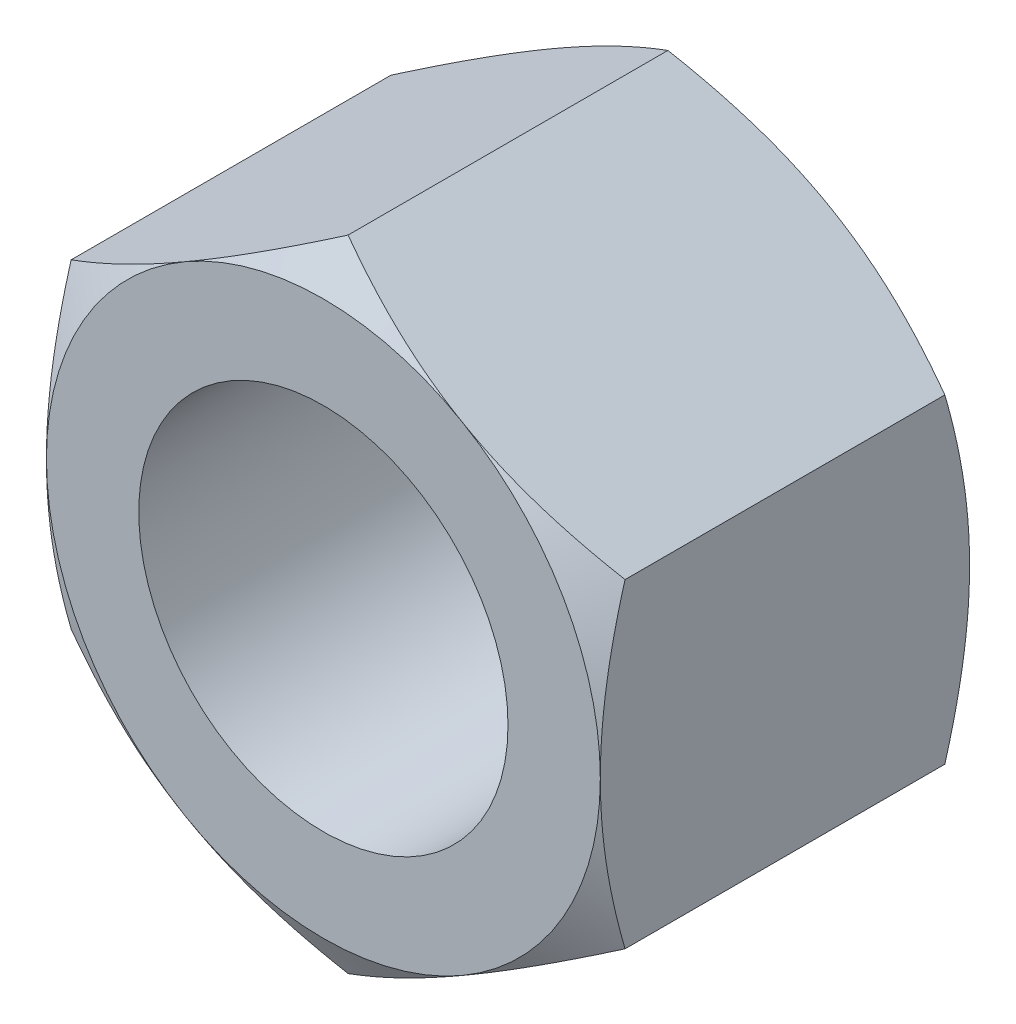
ISO-10303-21;
HEADER;
FILE_DESCRIPTION(('STEP AP214'),'2;1');
FILE_NAME('part.step','',(''),(''),'','','');
FILE_SCHEMA(('AUTOMOTIVE_DESIGN { 1 0 10303 214 1 1 1 1 }'));
ENDSEC;
DATA;
#1=APPLICATION_CONTEXT('core data for automotive mechanical design processes');
#2=APPLICATION_PROTOCOL_DEFINITION('international standard','automotive_design',2000,#1);
#3=PRODUCT_CONTEXT('',#1,'mechanical');
#4=PRODUCT('Part','Part','',(#3));
#5=PRODUCT_RELATED_PRODUCT_CATEGORY('part','',(#4));
#6=PRODUCT_DEFINITION_FORMATION('','',#4);
#7=PRODUCT_DEFINITION_CONTEXT('part definition',#1,'design');
#8=PRODUCT_DEFINITION('design','',#6,#7);
#9=PRODUCT_DEFINITION_SHAPE('','',#8);
#10=(LENGTH_UNIT() NAMED_UNIT(*) SI_UNIT(.MILLI.,.METRE.));
#11=(NAMED_UNIT(*) PLANE_ANGLE_UNIT() SI_UNIT($,.RADIAN.));
#12=(NAMED_UNIT(*) SI_UNIT($,.STERADIAN.) SOLID_ANGLE_UNIT());
#13=UNCERTAINTY_MEASURE_WITH_UNIT(LENGTH_MEASURE(1.E-05),#10,'distance_accuracy_value','');
#14=(GEOMETRIC_REPRESENTATION_CONTEXT(3) GLOBAL_UNCERTAINTY_ASSIGNED_CONTEXT((#13)) GLOBAL_UNIT_ASSIGNED_CONTEXT((#10,
#11,#12)) REPRESENTATION_CONTEXT('',''));
#15=CARTESIAN_POINT('',(0.,0.,0.));
#16=DIRECTION('',(0.,0.,1.));
#17=DIRECTION('',(1.,0.,0.));
#18=AXIS2_PLACEMENT_3D('',#15,#16,#17);
#19=CARTESIAN_POINT('',(-9.,15.5884572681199,0.));
#20=DIRECTION('',(0.,0.,-1.));
#21=DIRECTION('',(-1.,0.,0.));
#22=AXIS2_PLACEMENT_3D('',#19,#20,#21);
#23=PLANE('',#22);
#24=CARTESIAN_POINT('',(0.,0.,0.));
#25=DIRECTION('',(0.,0.,1.));
#26=DIRECTION('',(1.,0.,0.));
#27=AXIS2_PLACEMENT_3D('',#24,#25,#26);
#28=CIRCLE('',#27,6.);
#29=CARTESIAN_POINT('',(6.,0.,0.));
#30=VERTEX_POINT('',#29);
#31=EDGE_CURVE('E324',#30,#30,#28,.T.);
#32=ORIENTED_EDGE('',*,*,#31,.F.);
#33=EDGE_LOOP('',(#32));
#34=FACE_BOUND('',#33,.T.);
#35=CARTESIAN_POINT('',(0.,0.,0.));
#36=DIRECTION('',(0.,0.,-1.));
#37=DIRECTION('',(-1.,0.,0.));
#38=AXIS2_PLACEMENT_3D('',#35,#36,#37);
#39=CIRCLE('',#38,9.);
#40=CARTESIAN_POINT('',(-9.,0.,0.));
#41=VERTEX_POINT('',#40);
#42=CARTESIAN_POINT('',(-4.5,7.79422863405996,0.));
#43=VERTEX_POINT('',#42);
#44=EDGE_CURVE('E332',#41,#43,#39,.T.);
#45=ORIENTED_EDGE('',*,*,#44,.F.);
#46=CARTESIAN_POINT('',(0.,0.,0.));
#47=DIRECTION('',(0.,0.,-1.));
#48=DIRECTION('',(-1.,0.,0.));
#49=AXIS2_PLACEMENT_3D('',#46,#47,#48);
#50=CIRCLE('',#49,9.);
#51=CARTESIAN_POINT('',(-4.5,-7.79422863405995,0.));
#52=VERTEX_POINT('',#51);
#53=EDGE_CURVE('E154',#41,#52,#50,.F.);
#54=ORIENTED_EDGE('',*,*,#53,.T.);
#55=CARTESIAN_POINT('',(4.5,-7.79422863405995,0.));
#56=VERTEX_POINT('',#55);
#57=EDGE_CURVE('E256',#52,#56,#50,.F.);
#58=ORIENTED_EDGE('',*,*,#57,.T.);
#59=CARTESIAN_POINT('',(9.,0.,0.));
#60=VERTEX_POINT('',#59);
#61=EDGE_CURVE('E157',#56,#60,#50,.F.);
#62=ORIENTED_EDGE('',*,*,#61,.T.);
#63=CARTESIAN_POINT('',(4.5,7.79422863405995,0.));
#64=VERTEX_POINT('',#63);
#65=EDGE_CURVE('E132',#60,#64,#50,.F.);
#66=ORIENTED_EDGE('',*,*,#65,.T.);
#67=EDGE_CURVE('E145',#64,#43,#50,.F.);
#68=ORIENTED_EDGE('',*,*,#67,.T.);
#69=EDGE_LOOP('',(#45,#54,#58,#62,#66,#68));
#70=FACE_BOUND('',#69,.T.);
#71=ADVANCED_FACE('F37',(#34,#70),#23,.F.);
#72=CARTESIAN_POINT('',(0.,0.,0.));
#73=DIRECTION('',(0.,0.,-1.));
#74=DIRECTION('',(-1.,0.,0.));
#75=AXIS2_PLACEMENT_3D('',#72,#73,#74);
#76=CONICAL_SURFACE('',#75,9.,1.0471975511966);
#77=CARTESIAN_POINT('',(-9.,-14.08790952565,-4.4556038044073));
#78=CARTESIAN_POINT('',(-9.,-13.6936550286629,-4.26383430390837));
#79=CARTESIAN_POINT('',(-9.,-13.2985092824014,-4.07386641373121));
#80=CARTESIAN_POINT('',(-9.,-12.505961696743,-3.69854474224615));
#81=CARTESIAN_POINT('',(-9.,-12.1085595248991,-3.51319166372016));
#82=CARTESIAN_POINT('',(-9.,-11.309040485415,-3.14720601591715));
#83=CARTESIAN_POINT('',(-9.,-10.9069098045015,-2.96660352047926));
#84=CARTESIAN_POINT('',(-9.,-10.0994948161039,-2.61261874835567));
#85=CARTESIAN_POINT('',(-9.,-9.69421065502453,-2.43923613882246));
#86=CARTESIAN_POINT('',(-9.,-8.86637898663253,-2.09601068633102));
#87=CARTESIAN_POINT('',(-9.,-8.44370370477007,-1.92647435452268));
#88=CARTESIAN_POINT('',(-9.,-7.59345787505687,-1.59991987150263));
#89=CARTESIAN_POINT('',(-9.,-7.16588679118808,-1.44290310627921));
#90=CARTESIAN_POINT('',(-9.,-6.30592235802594,-1.14541403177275));
#91=CARTESIAN_POINT('',(-9.,-5.87354032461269,-1.00490935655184));
#92=CARTESIAN_POINT('',(-9.,-5.00259089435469,-0.744864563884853));
#93=CARTESIAN_POINT('',(-9.,-4.56402544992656,-0.625317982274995));
#94=CARTESIAN_POINT('',(-9.,-3.68279147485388,-0.413474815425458));
#95=CARTESIAN_POINT('',(-9.,-3.24015978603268,-0.321029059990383));
#96=CARTESIAN_POINT('',(-9.,-2.57207975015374,-0.206633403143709));
#97=CARTESIAN_POINT('',(-9.,-2.3486825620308,-0.172545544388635));
#98=CARTESIAN_POINT('',(-9.,-1.90073399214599,-0.113126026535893));
#99=CARTESIAN_POINT('',(-9.,-1.67618272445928,-0.087793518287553));
#100=CARTESIAN_POINT('',(-9.,-1.22921881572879,-0.0467142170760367));
#101=CARTESIAN_POINT('',(-9.,-1.00681754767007,-0.0308441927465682));
#102=CARTESIAN_POINT('',(-9.,-0.561542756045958,-0.00852954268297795));
#103=CARTESIAN_POINT('',(-9.,-0.338669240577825,-0.00208475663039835));
#104=CARTESIAN_POINT('',(-9.,0.107152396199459,0.00122518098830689));
#105=CARTESIAN_POINT('',(-9.,0.330100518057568,-0.00190973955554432));
#106=CARTESIAN_POINT('',(-9.,0.775663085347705,-0.0176810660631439));
#107=CARTESIAN_POINT('',(-9.,0.998277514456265,-0.0303179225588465));
#108=CARTESIAN_POINT('',(-9.,1.52928538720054,-0.0715230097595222));
#109=CARTESIAN_POINT('',(-9.,1.83735365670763,-0.10437680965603));
#110=CARTESIAN_POINT('',(-9.,2.45127496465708,-0.186519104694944));
#111=CARTESIAN_POINT('',(-9.,2.75712771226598,-0.235809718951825));
#112=CARTESIAN_POINT('',(-9.,3.67096429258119,-0.405728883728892));
#113=CARTESIAN_POINT('',(-9.,4.27491194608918,-0.548377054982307));
#114=CARTESIAN_POINT('',(-9.,5.17834875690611,-0.796700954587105));
#115=CARTESIAN_POINT('',(-9.,5.48249505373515,-0.886415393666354));
#116=CARTESIAN_POINT('',(-9.,6.08783493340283,-1.07539562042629));
#117=CARTESIAN_POINT('',(-9.,6.38902849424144,-1.17466147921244));
#118=CARTESIAN_POINT('',(-9.,6.98855625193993,-1.38113229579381));
#119=CARTESIAN_POINT('',(-9.,7.28689127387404,-1.48833487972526));
#120=CARTESIAN_POINT('',(-9.,7.88107084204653,-1.7093943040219));
#121=CARTESIAN_POINT('',(-9.,8.17691543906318,-1.82325100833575));
#122=CARTESIAN_POINT('',(-9.,8.95441621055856,-2.13091334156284));
#123=CARTESIAN_POINT('',(-9.,9.43422210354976,-2.32938977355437));
#124=CARTESIAN_POINT('',(-9.,10.3890689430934,-2.73752989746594));
#125=CARTESIAN_POINT('',(-9.,10.8641094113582,-2.94719469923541));
#126=CARTESIAN_POINT('',(-9.,11.8104820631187,-3.37513574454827));
#127=CARTESIAN_POINT('',(-9.,12.2818128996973,-3.59341495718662));
#128=CARTESIAN_POINT('',(-9.,13.2213264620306,-4.0365822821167));
#129=CARTESIAN_POINT('',(-9.,13.6895093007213,-4.26147015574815));
#130=CARTESIAN_POINT('',(-9.,14.6240308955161,-4.71679166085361));
#131=CARTESIAN_POINT('',(-9.,15.0903658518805,-4.94723307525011));
#132=CARTESIAN_POINT('',(-9.,16.0209541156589,-5.41228312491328));
#133=CARTESIAN_POINT('',(-9.,16.4852074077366,-5.64689179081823));
#134=CARTESIAN_POINT('',(-9.,17.4119022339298,-6.11942878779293));
#135=CARTESIAN_POINT('',(-9.,17.8743441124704,-6.3573564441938));
#136=CARTESIAN_POINT('',(-9.,18.7977988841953,-6.83597043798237));
#137=CARTESIAN_POINT('',(-9.,19.258811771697,-7.0766567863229));
#138=CARTESIAN_POINT('',(-9.,20.5465513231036,-7.75300835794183));
#139=CARTESIAN_POINT('',(-9.,21.3719486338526,-8.19120416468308));
#140=CARTESIAN_POINT('',(-9.,23.0199314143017,-9.0729490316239));
#141=CARTESIAN_POINT('',(-9.,23.8425167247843,-9.51649838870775));
#142=CARTESIAN_POINT('',(-9.,25.4829119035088,-10.4061980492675));
#143=CARTESIAN_POINT('',(-9.,26.3007286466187,-10.8523356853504));
#144=CARTESIAN_POINT('',(-9.,27.5261617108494,-11.5238268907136));
#145=CARTESIAN_POINT('',(-9.,27.9344093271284,-11.7480299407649));
#146=CARTESIAN_POINT('',(-9.,28.7505282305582,-12.1971187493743));
#147=CARTESIAN_POINT('',(-9.,29.1583995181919,-12.4220045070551));
#148=CARTESIAN_POINT('',(-9.,29.5661053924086,-12.6471898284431));
#149=B_SPLINE_CURVE_WITH_KNOTS('',3,(#77,#78,#79,#80,#81,#82,#83,#84,#85,#86,#87,#88,#89,#90,
#91,#92,#93,#94,#95,#96,#97,#98,#99,#100,#101,#102,#103,#104,#105,#106,#107,#108,#109,#110,#111,
#112,#113,#114,#115,#116,#117,#118,#119,#120,#121,#122,#123,#124,#125,#126,#127,#128,#129,#130,
#131,#132,#133,#134,#135,#136,#137,#138,#139,#140,#141,#142,#143,#144,#145,#146,#147,#148),
.UNSPECIFIED.,.F.,.F.,(4,2,2,2,2,2,2,2,2,2,2,2,2,2,2,2,2,2,2,2,2,2,2,2,2,2,2,2,2,2,2,2,2,2,2,4),
(0.,1.31527562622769,2.63075034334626,3.95316726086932,5.27552314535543,6.6415948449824,
8.00781756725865,9.37131599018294,10.7343931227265,12.0898202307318,12.7676245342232,
13.4453630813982,14.1140707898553,14.7827671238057,15.4514684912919,16.1202015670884,
17.0491251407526,17.9781685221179,19.8371982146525,20.7884210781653,21.7396510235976,
22.6905975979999,23.6415247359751,25.199025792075,26.7566816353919,28.3148791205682,
29.8730204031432,31.4334893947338,32.9939698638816,34.5541376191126,36.1143115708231,
38.9177907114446,41.7214260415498,44.5161918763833,45.9134738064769,47.3107539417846),.UNSPECIFIED.);
#150=CARTESIAN_POINT('',(-9.,5.19615242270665,-0.803847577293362));
#151=VERTEX_POINT('',#150);
#152=EDGE_CURVE('E162',#151,#41,#149,.F.);
#153=ORIENTED_EDGE('',*,*,#152,.T.);
#154=ORIENTED_EDGE('',*,*,#44,.T.);
#155=CARTESIAN_POINT('',(0.000200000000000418,10.3924203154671,-0.803914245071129));
#156=CARTESIAN_POINT('',(-0.197607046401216,10.2782163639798,-0.737982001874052));
#157=CARTESIAN_POINT('',(-0.396185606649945,10.1635669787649,-0.67504140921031));
#158=CARTESIAN_POINT('',(-0.794955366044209,9.93333715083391,-0.555968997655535));
#159=CARTESIAN_POINT('',(-0.99514722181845,9.81775632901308,-0.499840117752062));
#160=CARTESIAN_POINT('',(-1.3975150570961,9.58544915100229,-0.395151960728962));
#161=CARTESIAN_POINT('',(-1.5996945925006,9.46872074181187,-0.346610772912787));
#162=CARTESIAN_POINT('',(-2.00542875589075,9.23447001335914,-0.258148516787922));
#163=CARTESIAN_POINT('',(-2.20898309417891,9.11694786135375,-0.218225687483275));
#164=CARTESIAN_POINT('',(-2.61230590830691,8.88408932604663,-0.148684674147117));
#165=CARTESIAN_POINT('',(-2.812044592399,8.76877014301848,-0.118837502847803));
#166=CARTESIAN_POINT('',(-3.21241567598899,8.53761579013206,-0.0687933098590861));
#167=CARTESIAN_POINT('',(-3.41304799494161,8.42178066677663,-0.048595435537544));
#168=CARTESIAN_POINT('',(-3.81466063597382,8.18990950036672,-0.0183543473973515));
#169=CARTESIAN_POINT('',(-4.01564030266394,8.07387383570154,-0.00829960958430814));
#170=CARTESIAN_POINT('',(-4.41778459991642,7.84169571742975,0.00143766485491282));
#171=CARTESIAN_POINT('',(-4.61894922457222,7.72555326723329,0.00112052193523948));
#172=CARTESIAN_POINT('',(-4.9950326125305,7.50842142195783,-0.00916395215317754));
#173=CARTESIAN_POINT('',(-5.16997789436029,7.40741671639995,-0.0178767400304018));
#174=CARTESIAN_POINT('',(-5.51945867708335,7.20564389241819,-0.0429773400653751));
#175=CARTESIAN_POINT('',(-5.69399414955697,7.10487579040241,-0.0593656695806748));
#176=CARTESIAN_POINT('',(-6.21692487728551,6.80296159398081,-0.119656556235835));
#177=CARTESIAN_POINT('',(-6.56439451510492,6.60234990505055,-0.174677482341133));
#178=CARTESIAN_POINT('',(-7.263019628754,6.19899850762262,-0.312230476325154));
#179=CARTESIAN_POINT('',(-7.61408594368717,5.99631027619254,-0.395345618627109));
#180=CARTESIAN_POINT('',(-8.31098330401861,5.59395639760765,-0.583982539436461));
#181=CARTESIAN_POINT('',(-8.65682327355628,5.39428559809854,-0.689460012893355));
#182=CARTESIAN_POINT('',(-9.0002,5.19603695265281,-0.803914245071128));
#183=B_SPLINE_CURVE_WITH_KNOTS('',3,(#155,#156,#157,#158,#159,#160,#161,#162,#163,#164,#165,
#166,#167,#168,#169,#170,#171,#172,#173,#174,#175,#176,#177,#178,#179,#180,#181,#182),
.UNSPECIFIED.,.F.,.F.,(4,2,2,2,2,2,2,2,2,2,2,2,2,4),(0.,0.713219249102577,1.42674513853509,
2.14194697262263,2.8570025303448,3.55449749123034,4.25193080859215,4.94857085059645,
5.64518936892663,6.25162976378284,6.8581110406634,8.07193747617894,9.31268391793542,
10.5509947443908),.UNSPECIFIED.);
#184=EDGE_CURVE('E194',#43,#151,#183,.T.);
#185=ORIENTED_EDGE('',*,*,#184,.T.);
#186=EDGE_LOOP('',(#153,#154,#185));
#187=FACE_BOUND('',#186,.T.);
#188=ADVANCED_FACE('F181',(#187),#76,.T.);
#189=CARTESIAN_POINT('',(9.0002,5.19603695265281,-0.803914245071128));
#190=CARTESIAN_POINT('',(8.80239295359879,5.31024090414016,-0.737982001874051));
#191=CARTESIAN_POINT('',(8.60381439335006,5.42489028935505,-0.675041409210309));
#192=CARTESIAN_POINT('',(8.20504463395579,5.65512011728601,-0.555968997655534));
#193=CARTESIAN_POINT('',(8.00485277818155,5.77070093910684,-0.499840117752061));
#194=CARTESIAN_POINT('',(7.6024849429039,6.00300811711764,-0.395151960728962));
#195=CARTESIAN_POINT('',(7.4003054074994,6.11973652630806,-0.346610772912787));
#196=CARTESIAN_POINT('',(6.99457124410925,6.35398725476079,-0.258148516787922));
#197=CARTESIAN_POINT('',(6.79101690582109,6.47150940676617,-0.218225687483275));
#198=CARTESIAN_POINT('',(6.38769409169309,6.70436794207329,-0.148684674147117));
#199=CARTESIAN_POINT('',(6.187955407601,6.81968712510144,-0.118837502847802));
#200=CARTESIAN_POINT('',(5.787584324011,7.05084147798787,-0.0687933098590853));
#201=CARTESIAN_POINT('',(5.58695200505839,7.1666766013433,-0.0485954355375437));
#202=CARTESIAN_POINT('',(5.18533936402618,7.3985477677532,-0.0183543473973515));
#203=CARTESIAN_POINT('',(4.98435969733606,7.51458343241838,-0.00829960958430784));
#204=CARTESIAN_POINT('',(4.58221540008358,7.74676155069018,0.00143766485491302));
#205=CARTESIAN_POINT('',(4.38105077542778,7.86290400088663,0.00112052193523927));
#206=CARTESIAN_POINT('',(4.0049673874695,8.08003584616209,-0.00916395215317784));
#207=CARTESIAN_POINT('',(3.83002210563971,8.18104055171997,-0.0178767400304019));
#208=CARTESIAN_POINT('',(3.48054132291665,8.38281337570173,-0.042977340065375));
#209=CARTESIAN_POINT('',(3.30600585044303,8.48358147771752,-0.0593656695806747));
#210=CARTESIAN_POINT('',(2.78307512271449,8.78549567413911,-0.119656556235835));
#211=CARTESIAN_POINT('',(2.43560548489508,8.98610736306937,-0.174677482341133));
#212=CARTESIAN_POINT('',(1.736980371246,9.3894587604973,-0.312230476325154));
#213=CARTESIAN_POINT('',(1.38591405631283,9.59214699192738,-0.395345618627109));
#214=CARTESIAN_POINT('',(0.689016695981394,9.99450087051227,-0.583982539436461));
#215=CARTESIAN_POINT('',(0.343176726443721,10.1941716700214,-0.689460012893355));
#216=CARTESIAN_POINT('',(-0.000200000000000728,10.3924203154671,-0.803914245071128));
#217=B_SPLINE_CURVE_WITH_KNOTS('',3,(#189,#190,#191,#192,#193,#194,#195,#196,#197,#198,#199,
#200,#201,#202,#203,#204,#205,#206,#207,#208,#209,#210,#211,#212,#213,#214,#215,#216),
.UNSPECIFIED.,.F.,.F.,(4,2,2,2,2,2,2,2,2,2,2,2,2,4),(0.,0.713219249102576,1.42674513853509,
2.14194697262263,2.8570025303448,3.55449749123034,4.25193080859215,4.94857085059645,
5.64518936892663,6.25162976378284,6.8581110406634,8.07193747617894,9.31268391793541,
10.5509947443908),.UNSPECIFIED.);
#218=CARTESIAN_POINT('',(0.,10.3923048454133,-0.803847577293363));
#219=VERTEX_POINT('',#218);
#220=EDGE_CURVE('E141',#64,#219,#217,.T.);
#221=ORIENTED_EDGE('',*,*,#220,.T.);
#222=EDGE_CURVE('E148',#219,#43,#183,.T.);
#223=ORIENTED_EDGE('',*,*,#222,.T.);
#224=ORIENTED_EDGE('',*,*,#67,.F.);
#225=EDGE_LOOP('',(#221,#223,#224));
#226=FACE_BOUND('',#225,.T.);
#227=ADVANCED_FACE('F146',(#226),#76,.T.);
#228=CARTESIAN_POINT('',(9.,-14.08790952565,-4.4556038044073));
#229=CARTESIAN_POINT('',(9.,-13.6936550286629,-4.26383430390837));
#230=CARTESIAN_POINT('',(9.,-13.2985092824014,-4.07386641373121));
#231=CARTESIAN_POINT('',(9.,-12.505961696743,-3.69854474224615));
#232=CARTESIAN_POINT('',(9.,-12.1085595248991,-3.51319166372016));
#233=CARTESIAN_POINT('',(9.,-11.309040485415,-3.14720601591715));
#234=CARTESIAN_POINT('',(9.,-10.9069098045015,-2.96660352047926));
#235=CARTESIAN_POINT('',(9.,-10.0994948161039,-2.61261874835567));
#236=CARTESIAN_POINT('',(9.,-9.69421065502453,-2.43923613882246));
#237=CARTESIAN_POINT('',(9.,-8.86637898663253,-2.09601068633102));
#238=CARTESIAN_POINT('',(9.,-8.44370370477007,-1.92647435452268));
#239=CARTESIAN_POINT('',(9.,-7.59345787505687,-1.59991987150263));
#240=CARTESIAN_POINT('',(9.,-7.16588679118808,-1.44290310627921));
#241=CARTESIAN_POINT('',(9.,-6.30592235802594,-1.14541403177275));
#242=CARTESIAN_POINT('',(9.,-5.87354032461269,-1.00490935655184));
#243=CARTESIAN_POINT('',(9.,-5.00259089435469,-0.744864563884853));
#244=CARTESIAN_POINT('',(9.,-4.56402544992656,-0.625317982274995));
#245=CARTESIAN_POINT('',(9.,-3.68279147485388,-0.413474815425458));
#246=CARTESIAN_POINT('',(9.,-3.24015978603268,-0.321029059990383));
#247=CARTESIAN_POINT('',(9.,-2.57207975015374,-0.206633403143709));
#248=CARTESIAN_POINT('',(9.,-2.3486825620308,-0.172545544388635));
#249=CARTESIAN_POINT('',(9.,-1.90073399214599,-0.113126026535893));
#250=CARTESIAN_POINT('',(9.,-1.67618272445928,-0.087793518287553));
#251=CARTESIAN_POINT('',(9.,-1.22921881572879,-0.0467142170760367));
#252=CARTESIAN_POINT('',(9.,-1.00681754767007,-0.0308441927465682));
#253=CARTESIAN_POINT('',(9.,-0.561542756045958,-0.00852954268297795));
#254=CARTESIAN_POINT('',(9.,-0.338669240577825,-0.00208475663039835));
#255=CARTESIAN_POINT('',(9.,0.107152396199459,0.00122518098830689));
#256=CARTESIAN_POINT('',(9.,0.330100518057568,-0.00190973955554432));
#257=CARTESIAN_POINT('',(9.,0.775663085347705,-0.0176810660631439));
#258=CARTESIAN_POINT('',(9.,0.998277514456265,-0.0303179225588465));
#259=CARTESIAN_POINT('',(9.,1.52928538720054,-0.0715230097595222));
#260=CARTESIAN_POINT('',(9.,1.83735365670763,-0.10437680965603));
#261=CARTESIAN_POINT('',(9.,2.45127496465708,-0.186519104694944));
#262=CARTESIAN_POINT('',(9.,2.75712771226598,-0.235809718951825));
#263=CARTESIAN_POINT('',(9.,3.67096429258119,-0.405728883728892));
#264=CARTESIAN_POINT('',(9.,4.27491194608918,-0.548377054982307));
#265=CARTESIAN_POINT('',(9.,5.17834875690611,-0.796700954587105));
#266=CARTESIAN_POINT('',(9.,5.48249505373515,-0.886415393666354));
#267=CARTESIAN_POINT('',(9.,6.08783493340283,-1.07539562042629));
#268=CARTESIAN_POINT('',(9.,6.38902849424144,-1.17466147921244));
#269=CARTESIAN_POINT('',(9.,6.98855625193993,-1.38113229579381));
#270=CARTESIAN_POINT('',(9.,7.28689127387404,-1.48833487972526));
#271=CARTESIAN_POINT('',(9.,7.88107084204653,-1.7093943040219));
#272=CARTESIAN_POINT('',(9.,8.17691543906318,-1.82325100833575));
#273=CARTESIAN_POINT('',(9.,8.95441621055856,-2.13091334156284));
#274=CARTESIAN_POINT('',(9.,9.43422210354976,-2.32938977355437));
#275=CARTESIAN_POINT('',(9.,10.3890689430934,-2.73752989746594));
#276=CARTESIAN_POINT('',(9.,10.8641094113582,-2.94719469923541));
#277=CARTESIAN_POINT('',(9.,11.8104820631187,-3.37513574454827));
#278=CARTESIAN_POINT('',(9.,12.2818128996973,-3.59341495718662));
#279=CARTESIAN_POINT('',(9.,13.2213264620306,-4.0365822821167));
#280=CARTESIAN_POINT('',(9.,13.6895093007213,-4.26147015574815));
#281=CARTESIAN_POINT('',(9.,14.6240308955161,-4.71679166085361));
#282=CARTESIAN_POINT('',(9.,15.0903658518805,-4.94723307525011));
#283=CARTESIAN_POINT('',(9.,16.0209541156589,-5.41228312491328));
#284=CARTESIAN_POINT('',(9.,16.4852074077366,-5.64689179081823));
#285=CARTESIAN_POINT('',(9.,17.4119022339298,-6.11942878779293));
#286=CARTESIAN_POINT('',(9.,17.8743441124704,-6.3573564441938));
#287=CARTESIAN_POINT('',(9.,18.7977988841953,-6.83597043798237));
#288=CARTESIAN_POINT('',(9.,19.258811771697,-7.0766567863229));
#289=CARTESIAN_POINT('',(9.,20.5465513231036,-7.75300835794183));
#290=CARTESIAN_POINT('',(9.,21.3719486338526,-8.19120416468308));
#291=CARTESIAN_POINT('',(9.,23.0199314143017,-9.0729490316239));
#292=CARTESIAN_POINT('',(9.,23.8425167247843,-9.51649838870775));
#293=CARTESIAN_POINT('',(9.,25.4829119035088,-10.4061980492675));
#294=CARTESIAN_POINT('',(9.,26.3007286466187,-10.8523356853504));
#295=CARTESIAN_POINT('',(9.,27.5261617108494,-11.5238268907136));
#296=CARTESIAN_POINT('',(9.,27.9344093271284,-11.7480299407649));
#297=CARTESIAN_POINT('',(9.,28.7505282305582,-12.1971187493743));
#298=CARTESIAN_POINT('',(9.,29.1583995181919,-12.4220045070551));
#299=CARTESIAN_POINT('',(9.,29.5661053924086,-12.6471898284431));
#300=B_SPLINE_CURVE_WITH_KNOTS('',3,(#228,#229,#230,#231,#232,#233,#234,#235,#236,#237,#238,
#239,#240,#241,#242,#243,#244,#245,#246,#247,#248,#249,#250,#251,#252,#253,#254,#255,#256,#257,
#258,#259,#260,#261,#262,#263,#264,#265,#266,#267,#268,#269,#270,#271,#272,#273,#274,#275,#276,
#277,#278,#279,#280,#281,#282,#283,#284,#285,#286,#287,#288,#289,#290,#291,#292,#293,#294,#295,
#296,#297,#298,#299),.UNSPECIFIED.,.F.,.F.,(4,2,2,2,2,2,2,2,2,2,2,2,2,2,2,2,2,2,2,2,2,2,2,2,2,2,
2,2,2,2,2,2,2,2,2,4),(0.,1.31527562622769,2.63075034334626,3.95316726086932,5.27552314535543,
6.6415948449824,8.00781756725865,9.37131599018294,10.7343931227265,12.0898202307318,
12.7676245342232,13.4453630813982,14.1140707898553,14.7827671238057,15.4514684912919,
16.1202015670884,17.0491251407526,17.9781685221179,19.8371982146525,20.7884210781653,
21.7396510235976,22.6905975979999,23.6415247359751,25.199025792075,26.7566816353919,
28.3148791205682,29.8730204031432,31.4334893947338,32.9939698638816,34.5541376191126,
36.1143115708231,38.9177907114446,41.7214260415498,44.5161918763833,45.9134738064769,
47.3107539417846),.UNSPECIFIED.);
#301=CARTESIAN_POINT('',(9.,5.19615242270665,-0.803847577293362));
#302=VERTEX_POINT('',#301);
#303=EDGE_CURVE('E135',#60,#302,#300,.T.);
#304=ORIENTED_EDGE('',*,*,#303,.T.);
#305=EDGE_CURVE('E128',#302,#64,#217,.T.);
#306=ORIENTED_EDGE('',*,*,#305,.T.);
#307=ORIENTED_EDGE('',*,*,#65,.F.);
#308=EDGE_LOOP('',(#304,#306,#307));
#309=FACE_BOUND('',#308,.T.);
#310=ADVANCED_FACE('F130',(#309),#76,.T.);
#311=CARTESIAN_POINT('',(-0.000200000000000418,-10.3924203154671,-0.803914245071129));
#312=CARTESIAN_POINT('',(0.197607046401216,-10.2782163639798,-0.737982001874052));
#313=CARTESIAN_POINT('',(0.396185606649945,-10.1635669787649,-0.67504140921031));
#314=CARTESIAN_POINT('',(0.794955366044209,-9.93333715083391,-0.555968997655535));
#315=CARTESIAN_POINT('',(0.99514722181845,-9.81775632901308,-0.499840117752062));
#316=CARTESIAN_POINT('',(1.3975150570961,-9.58544915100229,-0.395151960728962));
#317=CARTESIAN_POINT('',(1.5996945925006,-9.46872074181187,-0.346610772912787));
#318=CARTESIAN_POINT('',(2.00542875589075,-9.23447001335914,-0.258148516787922));
#319=CARTESIAN_POINT('',(2.20898309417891,-9.11694786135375,-0.218225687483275));
#320=CARTESIAN_POINT('',(2.61230590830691,-8.88408932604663,-0.148684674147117));
#321=CARTESIAN_POINT('',(2.812044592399,-8.76877014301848,-0.118837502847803));
#322=CARTESIAN_POINT('',(3.21241567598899,-8.53761579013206,-0.0687933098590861));
#323=CARTESIAN_POINT('',(3.41304799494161,-8.42178066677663,-0.048595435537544));
#324=CARTESIAN_POINT('',(3.81466063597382,-8.18990950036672,-0.0183543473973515));
#325=CARTESIAN_POINT('',(4.01564030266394,-8.07387383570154,-0.00829960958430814));
#326=CARTESIAN_POINT('',(4.41778459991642,-7.84169571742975,0.00143766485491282));
#327=CARTESIAN_POINT('',(4.61894922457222,-7.72555326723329,0.00112052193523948));
#328=CARTESIAN_POINT('',(4.9950326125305,-7.50842142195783,-0.00916395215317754));
#329=CARTESIAN_POINT('',(5.16997789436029,-7.40741671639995,-0.0178767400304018));
#330=CARTESIAN_POINT('',(5.51945867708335,-7.20564389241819,-0.0429773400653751));
#331=CARTESIAN_POINT('',(5.69399414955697,-7.10487579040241,-0.0593656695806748));
#332=CARTESIAN_POINT('',(6.21692487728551,-6.80296159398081,-0.119656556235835));
#333=CARTESIAN_POINT('',(6.56439451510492,-6.60234990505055,-0.174677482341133));
#334=CARTESIAN_POINT('',(7.263019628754,-6.19899850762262,-0.312230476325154));
#335=CARTESIAN_POINT('',(7.61408594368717,-5.99631027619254,-0.395345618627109));
#336=CARTESIAN_POINT('',(8.31098330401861,-5.59395639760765,-0.583982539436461));
#337=CARTESIAN_POINT('',(8.65682327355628,-5.39428559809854,-0.689460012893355));
#338=CARTESIAN_POINT('',(9.0002,-5.19603695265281,-0.803914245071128));
#339=B_SPLINE_CURVE_WITH_KNOTS('',3,(#311,#312,#313,#314,#315,#316,#317,#318,#319,#320,#321,
#322,#323,#324,#325,#326,#327,#328,#329,#330,#331,#332,#333,#334,#335,#336,#337,#338),
.UNSPECIFIED.,.F.,.F.,(4,2,2,2,2,2,2,2,2,2,2,2,2,4),(0.,0.713219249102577,1.42674513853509,
2.14194697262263,2.8570025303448,3.55449749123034,4.25193080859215,4.94857085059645,
5.64518936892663,6.25162976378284,6.8581110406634,8.07193747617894,9.31268391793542,
10.5509947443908),.UNSPECIFIED.);
#340=CARTESIAN_POINT('',(9.,-5.19615242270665,-0.803847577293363));
#341=VERTEX_POINT('',#340);
#342=EDGE_CURVE('E208',#56,#341,#339,.T.);
#343=ORIENTED_EDGE('',*,*,#342,.T.);
#344=EDGE_CURVE('E207',#341,#60,#300,.T.);
#345=ORIENTED_EDGE('',*,*,#344,.T.);
#346=ORIENTED_EDGE('',*,*,#61,.F.);
#347=EDGE_LOOP('',(#343,#345,#346));
#348=FACE_BOUND('',#347,.T.);
#349=ADVANCED_FACE('F432',(#348),#76,.T.);
#350=CARTESIAN_POINT('',(0.,-10.3923048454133,-0.803847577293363));
#351=VERTEX_POINT('',#350);
#352=EDGE_CURVE('E266',#351,#56,#339,.T.);
#353=ORIENTED_EDGE('',*,*,#352,.T.);
#354=ORIENTED_EDGE('',*,*,#57,.F.);
#355=CARTESIAN_POINT('',(-9.0002,-5.19603695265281,-0.803914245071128));
#356=CARTESIAN_POINT('',(-8.80239295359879,-5.31024090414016,-0.737982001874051));
#357=CARTESIAN_POINT('',(-8.60381439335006,-5.42489028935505,-0.675041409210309));
#358=CARTESIAN_POINT('',(-8.20504463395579,-5.65512011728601,-0.555968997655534));
#359=CARTESIAN_POINT('',(-8.00485277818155,-5.77070093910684,-0.499840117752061));
#360=CARTESIAN_POINT('',(-7.6024849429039,-6.00300811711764,-0.395151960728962));
#361=CARTESIAN_POINT('',(-7.4003054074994,-6.11973652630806,-0.346610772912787));
#362=CARTESIAN_POINT('',(-6.99457124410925,-6.35398725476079,-0.258148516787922));
#363=CARTESIAN_POINT('',(-6.79101690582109,-6.47150940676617,-0.218225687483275));
#364=CARTESIAN_POINT('',(-6.38769409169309,-6.70436794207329,-0.148684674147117));
#365=CARTESIAN_POINT('',(-6.187955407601,-6.81968712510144,-0.118837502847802));
#366=CARTESIAN_POINT('',(-5.787584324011,-7.05084147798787,-0.0687933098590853));
#367=CARTESIAN_POINT('',(-5.58695200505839,-7.1666766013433,-0.0485954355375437));
#368=CARTESIAN_POINT('',(-5.18533936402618,-7.3985477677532,-0.0183543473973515));
#369=CARTESIAN_POINT('',(-4.98435969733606,-7.51458343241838,-0.00829960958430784));
#370=CARTESIAN_POINT('',(-4.58221540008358,-7.74676155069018,0.00143766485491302));
#371=CARTESIAN_POINT('',(-4.38105077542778,-7.86290400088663,0.00112052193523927));
#372=CARTESIAN_POINT('',(-4.0049673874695,-8.08003584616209,-0.00916395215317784));
#373=CARTESIAN_POINT('',(-3.83002210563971,-8.18104055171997,-0.0178767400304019));
#374=CARTESIAN_POINT('',(-3.48054132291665,-8.38281337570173,-0.042977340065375));
#375=CARTESIAN_POINT('',(-3.30600585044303,-8.48358147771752,-0.0593656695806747));
#376=CARTESIAN_POINT('',(-2.78307512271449,-8.78549567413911,-0.119656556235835));
#377=CARTESIAN_POINT('',(-2.43560548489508,-8.98610736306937,-0.174677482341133));
#378=CARTESIAN_POINT('',(-1.736980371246,-9.3894587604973,-0.312230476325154));
#379=CARTESIAN_POINT('',(-1.38591405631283,-9.59214699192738,-0.395345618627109));
#380=CARTESIAN_POINT('',(-0.689016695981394,-9.99450087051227,-0.583982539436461));
#381=CARTESIAN_POINT('',(-0.343176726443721,-10.1941716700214,-0.689460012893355));
#382=CARTESIAN_POINT('',(0.000200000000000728,-10.3924203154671,-0.803914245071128));
#383=B_SPLINE_CURVE_WITH_KNOTS('',3,(#355,#356,#357,#358,#359,#360,#361,#362,#363,#364,#365,
#366,#367,#368,#369,#370,#371,#372,#373,#374,#375,#376,#377,#378,#379,#380,#381,#382),
.UNSPECIFIED.,.F.,.F.,(4,2,2,2,2,2,2,2,2,2,2,2,2,4),(0.,0.713219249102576,1.42674513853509,
2.14194697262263,2.8570025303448,3.55449749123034,4.25193080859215,4.94857085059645,
5.64518936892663,6.25162976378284,6.8581110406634,8.07193747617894,9.31268391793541,
10.5509947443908),.UNSPECIFIED.);
#384=EDGE_CURVE('E270',#52,#351,#383,.T.);
#385=ORIENTED_EDGE('',*,*,#384,.T.);
#386=EDGE_LOOP('',(#353,#354,#385));
#387=FACE_BOUND('',#386,.T.);
#388=ADVANCED_FACE('F187',(#387),#76,.T.);
#389=CARTESIAN_POINT('',(-9.,-5.19615242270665,-0.803847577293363));
#390=VERTEX_POINT('',#389);
#391=EDGE_CURVE('E175',#390,#52,#383,.T.);
#392=ORIENTED_EDGE('',*,*,#391,.T.);
#393=ORIENTED_EDGE('',*,*,#53,.F.);
#394=EDGE_CURVE('E140',#41,#390,#149,.F.);
#395=ORIENTED_EDGE('',*,*,#394,.T.);
#396=EDGE_LOOP('',(#392,#393,#395));
#397=FACE_BOUND('',#396,.T.);
#398=ADVANCED_FACE('F275',(#397),#76,.T.);
#399=CARTESIAN_POINT('',(9.,5.19615242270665,-12.));
#400=DIRECTION('',(0.5,0.866025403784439,0.));
#401=DIRECTION('',(-0.866025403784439,0.5,0.));
#402=AXIS2_PLACEMENT_3D('',#399,#400,#401);
#403=PLANE('',#402);
#404=CARTESIAN_POINT('',(-0.0002,10.3924203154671,-11.1960857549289));
#405=CARTESIAN_POINT('',(0.197607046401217,10.2782163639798,-11.2620179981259));
#406=CARTESIAN_POINT('',(0.396185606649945,10.1635669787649,-11.3249585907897));
#407=CARTESIAN_POINT('',(0.794955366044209,9.93333715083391,-11.4440310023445));
#408=CARTESIAN_POINT('',(0.99514722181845,9.81775632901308,-11.5001598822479));
#409=CARTESIAN_POINT('',(1.3975150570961,9.58544915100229,-11.604848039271));
#410=CARTESIAN_POINT('',(1.5996945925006,9.46872074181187,-11.6533892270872));
#411=CARTESIAN_POINT('',(2.00542875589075,9.23447001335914,-11.7418514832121));
#412=CARTESIAN_POINT('',(2.20898309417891,9.11694786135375,-11.7817743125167));
#413=CARTESIAN_POINT('',(2.61230590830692,8.88408932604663,-11.8513153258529));
#414=CARTESIAN_POINT('',(2.81204459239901,8.76877014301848,-11.8811624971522));
#415=CARTESIAN_POINT('',(3.212415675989,8.53761579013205,-11.9312066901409));
#416=CARTESIAN_POINT('',(3.41304799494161,8.42178066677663,-11.9514045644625));
#417=CARTESIAN_POINT('',(3.81466063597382,8.18990950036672,-11.9816456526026));
#418=CARTESIAN_POINT('',(4.01564030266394,8.07387383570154,-11.9917003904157));
#419=CARTESIAN_POINT('',(4.41778459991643,7.84169571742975,-12.0014376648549));
#420=CARTESIAN_POINT('',(4.61894922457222,7.72555326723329,-12.0011205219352));
#421=CARTESIAN_POINT('',(4.9950326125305,7.50842142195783,-11.9908360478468));
#422=CARTESIAN_POINT('',(5.16997789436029,7.40741671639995,-11.9821232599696));
#423=CARTESIAN_POINT('',(5.51945867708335,7.20564389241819,-11.9570226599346));
#424=CARTESIAN_POINT('',(5.69399414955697,7.10487579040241,-11.9406343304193));
#425=CARTESIAN_POINT('',(6.21692487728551,6.80296159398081,-11.8803434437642));
#426=CARTESIAN_POINT('',(6.56439451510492,6.60234990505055,-11.8253225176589));
#427=CARTESIAN_POINT('',(7.263019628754,6.19899850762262,-11.6877695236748));
#428=CARTESIAN_POINT('',(7.61408594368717,5.99631027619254,-11.6046543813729));
#429=CARTESIAN_POINT('',(8.31098330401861,5.59395639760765,-11.4160174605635));
#430=CARTESIAN_POINT('',(8.65682327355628,5.39428559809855,-11.3105399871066));
#431=CARTESIAN_POINT('',(9.0002,5.19603695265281,-11.1960857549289));
#432=B_SPLINE_CURVE_WITH_KNOTS('',3,(#404,#405,#406,#407,#408,#409,#410,#411,#412,#413,#414,
#415,#416,#417,#418,#419,#420,#421,#422,#423,#424,#425,#426,#427,#428,#429,#430,#431),
.UNSPECIFIED.,.F.,.F.,(4,2,2,2,2,2,2,2,2,2,2,2,2,4),(0.,0.713219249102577,1.42674513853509,
2.14194697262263,2.8570025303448,3.55449749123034,4.25193080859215,4.94857085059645,
5.64518936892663,6.25162976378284,6.8581110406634,8.07193747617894,9.31268391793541,
10.5509947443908),.UNSPECIFIED.);
#433=CARTESIAN_POINT('',(0.,10.3923048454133,-11.1961524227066));
#434=VERTEX_POINT('',#433);
#435=CARTESIAN_POINT('',(4.5,7.79422863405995,-12.));
#436=VERTEX_POINT('',#435);
#437=EDGE_CURVE('E241',#434,#436,#432,.T.);
#438=ORIENTED_EDGE('',*,*,#437,.F.);
#439=DIRECTION('',(0.,0.,1.));
#440=VECTOR('',#439,1.);
#441=CARTESIAN_POINT('',(0.,10.3923048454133,-12.));
#442=LINE('',#441,#440);
#443=EDGE_CURVE('E161',#434,#219,#442,.T.);
#444=ORIENTED_EDGE('',*,*,#443,.T.);
#445=ORIENTED_EDGE('',*,*,#220,.F.);
#446=ORIENTED_EDGE('',*,*,#305,.F.);
#447=DIRECTION('',(0.,0.,1.));
#448=VECTOR('',#447,1.);
#449=CARTESIAN_POINT('',(9.,5.19615242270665,-12.));
#450=LINE('',#449,#448);
#451=CARTESIAN_POINT('',(9.,5.19615242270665,-11.1961524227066));
#452=VERTEX_POINT('',#451);
#453=EDGE_CURVE('E153',#452,#302,#450,.T.);
#454=ORIENTED_EDGE('',*,*,#453,.F.);
#455=EDGE_CURVE('E236',#436,#452,#432,.T.);
#456=ORIENTED_EDGE('',*,*,#455,.F.);
#457=EDGE_LOOP('',(#438,#444,#445,#446,#454,#456));
#458=FACE_BOUND('',#457,.T.);
#459=ADVANCED_FACE('F39',(#458),#403,.T.);
#460=CARTESIAN_POINT('',(9.,-5.19615242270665,-12.));
#461=DIRECTION('',(1.,0.,0.));
#462=DIRECTION('',(0.,0.,-1.));
#463=AXIS2_PLACEMENT_3D('',#460,#461,#462);
#464=PLANE('',#463);
#465=CARTESIAN_POINT('',(9.,-14.08790952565,-7.5443961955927));
#466=CARTESIAN_POINT('',(9.,-13.6936550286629,-7.73616569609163));
#467=CARTESIAN_POINT('',(9.,-13.2985092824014,-7.92613358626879));
#468=CARTESIAN_POINT('',(9.,-12.505961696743,-8.30145525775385));
#469=CARTESIAN_POINT('',(9.,-12.1085595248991,-8.48680833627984));
#470=CARTESIAN_POINT('',(9.,-11.309040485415,-8.85279398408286));
#471=CARTESIAN_POINT('',(9.,-10.9069098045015,-9.03339647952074));
#472=CARTESIAN_POINT('',(9.,-10.0994948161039,-9.38738125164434));
#473=CARTESIAN_POINT('',(9.,-9.69421065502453,-9.56076386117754));
#474=CARTESIAN_POINT('',(9.,-8.86637898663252,-9.90398931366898));
#475=CARTESIAN_POINT('',(9.,-8.44370370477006,-10.0735256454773));
#476=CARTESIAN_POINT('',(9.,-7.59345787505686,-10.4000801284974));
#477=CARTESIAN_POINT('',(9.,-7.16588679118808,-10.5570968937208));
#478=CARTESIAN_POINT('',(9.,-6.30592235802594,-10.8545859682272));
#479=CARTESIAN_POINT('',(9.,-5.87354032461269,-10.9950906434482));
#480=CARTESIAN_POINT('',(9.,-5.00259089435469,-11.2551354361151));
#481=CARTESIAN_POINT('',(9.,-4.56402544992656,-11.374682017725));
#482=CARTESIAN_POINT('',(9.,-3.68279147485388,-11.5865251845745));
#483=CARTESIAN_POINT('',(9.,-3.24015978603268,-11.6789709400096));
#484=CARTESIAN_POINT('',(9.,-2.57207975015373,-11.7933665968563));
#485=CARTESIAN_POINT('',(9.,-2.3486825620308,-11.8274544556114));
#486=CARTESIAN_POINT('',(9.,-1.90073399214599,-11.8868739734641));
#487=CARTESIAN_POINT('',(9.,-1.67618272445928,-11.9122064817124));
#488=CARTESIAN_POINT('',(9.,-1.22921881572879,-11.953285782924));
#489=CARTESIAN_POINT('',(9.,-1.00681754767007,-11.9691558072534));
#490=CARTESIAN_POINT('',(9.,-0.561542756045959,-11.991470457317));
#491=CARTESIAN_POINT('',(9.,-0.338669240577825,-11.9979152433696));
#492=CARTESIAN_POINT('',(9.,0.10715239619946,-12.0012251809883));
#493=CARTESIAN_POINT('',(9.,0.330100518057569,-11.9980902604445));
#494=CARTESIAN_POINT('',(9.,0.775663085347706,-11.9823189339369));
#495=CARTESIAN_POINT('',(9.,0.998277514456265,-11.9696820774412));
#496=CARTESIAN_POINT('',(9.,1.52928538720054,-11.9284769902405));
#497=CARTESIAN_POINT('',(9.,1.83735365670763,-11.895623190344));
#498=CARTESIAN_POINT('',(9.,2.45127496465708,-11.8134808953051));
#499=CARTESIAN_POINT('',(9.,2.75712771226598,-11.7641902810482));
#500=CARTESIAN_POINT('',(9.,3.67096429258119,-11.5942711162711));
#501=CARTESIAN_POINT('',(9.,4.27491194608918,-11.4516229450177));
#502=CARTESIAN_POINT('',(9.,5.17834875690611,-11.2032990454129));
#503=CARTESIAN_POINT('',(9.,5.48249505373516,-11.1135846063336));
#504=CARTESIAN_POINT('',(9.,6.08783493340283,-10.9246043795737));
#505=CARTESIAN_POINT('',(9.,6.38902849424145,-10.8253385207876));
#506=CARTESIAN_POINT('',(9.,6.98855625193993,-10.6188677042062));
#507=CARTESIAN_POINT('',(9.,7.28689127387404,-10.5116651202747));
#508=CARTESIAN_POINT('',(9.,7.88107084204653,-10.2906056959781));
#509=CARTESIAN_POINT('',(9.,8.17691543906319,-10.1767489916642));
#510=CARTESIAN_POINT('',(9.,8.95441621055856,-9.86908665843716));
#511=CARTESIAN_POINT('',(9.,9.43422210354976,-9.67061022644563));
#512=CARTESIAN_POINT('',(9.,10.3890689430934,-9.26247010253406));
#513=CARTESIAN_POINT('',(9.,10.8641094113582,-9.05280530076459));
#514=CARTESIAN_POINT('',(9.,11.8104820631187,-8.62486425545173));
#515=CARTESIAN_POINT('',(9.,12.2818128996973,-8.40658504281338));
#516=CARTESIAN_POINT('',(9.,13.2213264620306,-7.9634177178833));
#517=CARTESIAN_POINT('',(9.,13.6895093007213,-7.73852984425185));
#518=CARTESIAN_POINT('',(9.,14.6240308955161,-7.28320833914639));
#519=CARTESIAN_POINT('',(9.,15.0903658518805,-7.0527669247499));
#520=CARTESIAN_POINT('',(9.,16.0209541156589,-6.58771687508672));
#521=CARTESIAN_POINT('',(9.,16.4852074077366,-6.35310820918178));
#522=CARTESIAN_POINT('',(9.,17.4119022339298,-5.88057121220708));
#523=CARTESIAN_POINT('',(9.,17.8743441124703,-5.64264355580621));
#524=CARTESIAN_POINT('',(9.,18.7977988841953,-5.16402956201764));
#525=CARTESIAN_POINT('',(9.,19.258811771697,-4.9233432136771));
#526=CARTESIAN_POINT('',(9.,20.5465513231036,-4.24699164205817));
#527=CARTESIAN_POINT('',(9.,21.3719486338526,-3.80879583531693));
#528=CARTESIAN_POINT('',(9.,23.0199314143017,-2.9270509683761));
#529=CARTESIAN_POINT('',(9.,23.8425167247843,-2.48350161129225));
#530=CARTESIAN_POINT('',(9.,25.4829119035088,-1.59380195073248));
#531=CARTESIAN_POINT('',(9.,26.3007286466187,-1.14766431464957));
#532=CARTESIAN_POINT('',(9.,27.5261617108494,-0.476173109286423));
#533=CARTESIAN_POINT('',(9.,27.9344093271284,-0.251970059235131));
#534=CARTESIAN_POINT('',(9.,28.7505282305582,0.197118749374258));
#535=CARTESIAN_POINT('',(9.,29.1583995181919,0.422004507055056));
#536=CARTESIAN_POINT('',(9.,29.5661053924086,0.647189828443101));
#537=B_SPLINE_CURVE_WITH_KNOTS('',3,(#465,#466,#467,#468,#469,#470,#471,#472,#473,#474,#475,
#476,#477,#478,#479,#480,#481,#482,#483,#484,#485,#486,#487,#488,#489,#490,#491,#492,#493,#494,
#495,#496,#497,#498,#499,#500,#501,#502,#503,#504,#505,#506,#507,#508,#509,#510,#511,#512,#513,
#514,#515,#516,#517,#518,#519,#520,#521,#522,#523,#524,#525,#526,#527,#528,#529,#530,#531,#532,
#533,#534,#535,#536),.UNSPECIFIED.,.F.,.F.,(4,2,2,2,2,2,2,2,2,2,2,2,2,2,2,2,2,2,2,2,2,2,2,2,2,2,
2,2,2,2,2,2,2,2,2,4),(0.,1.31527562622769,2.63075034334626,3.95316726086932,5.27552314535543,
6.64159484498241,8.00781756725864,9.37131599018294,10.7343931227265,12.0898202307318,
12.7676245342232,13.4453630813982,14.1140707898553,14.7827671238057,15.4514684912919,
16.1202015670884,17.0491251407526,17.9781685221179,19.8371982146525,20.7884210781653,
21.7396510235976,22.6905975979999,23.6415247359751,25.199025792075,26.7566816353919,
28.3148791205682,29.8730204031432,31.4334893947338,32.9939698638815,34.5541376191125,
36.1143115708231,38.9177907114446,41.7214260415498,44.5161918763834,45.9134738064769,
47.3107539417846),.UNSPECIFIED.);
#538=CARTESIAN_POINT('',(9.,0.,-12.));
#539=VERTEX_POINT('',#538);
#540=EDGE_CURVE('E230',#452,#539,#537,.F.);
#541=ORIENTED_EDGE('',*,*,#540,.F.);
#542=ORIENTED_EDGE('',*,*,#453,.T.);
#543=ORIENTED_EDGE('',*,*,#303,.F.);
#544=ORIENTED_EDGE('',*,*,#344,.F.);
#545=DIRECTION('',(0.,0.,1.));
#546=VECTOR('',#545,1.);
#547=CARTESIAN_POINT('',(9.,-5.19615242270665,-12.));
#548=LINE('',#547,#546);
#549=CARTESIAN_POINT('',(9.,-5.19615242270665,-11.1961524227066));
#550=VERTEX_POINT('',#549);
#551=EDGE_CURVE('E243',#550,#341,#548,.T.);
#552=ORIENTED_EDGE('',*,*,#551,.F.);
#553=EDGE_CURVE('E224',#539,#550,#537,.F.);
#554=ORIENTED_EDGE('',*,*,#553,.F.);
#555=EDGE_LOOP('',(#541,#542,#543,#544,#552,#554));
#556=FACE_BOUND('',#555,.T.);
#557=ADVANCED_FACE('F214',(#556),#464,.T.);
#558=CARTESIAN_POINT('',(9.,-5.19615242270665,-12.));
#559=DIRECTION('',(0.5,-0.866025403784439,0.));
#560=DIRECTION('',(0.866025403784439,0.5,0.));
#561=AXIS2_PLACEMENT_3D('',#558,#559,#560);
#562=PLANE('',#561);
#563=CARTESIAN_POINT('',(9.0002,-5.19603695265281,-11.1960857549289));
#564=CARTESIAN_POINT('',(8.80239295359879,-5.31024090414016,-11.262017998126));
#565=CARTESIAN_POINT('',(8.60381439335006,-5.42489028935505,-11.3249585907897));
#566=CARTESIAN_POINT('',(8.20504463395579,-5.65512011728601,-11.4440310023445));
#567=CARTESIAN_POINT('',(8.00485277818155,-5.77070093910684,-11.5001598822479));
#568=CARTESIAN_POINT('',(7.6024849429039,-6.00300811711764,-11.604848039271));
#569=CARTESIAN_POINT('',(7.4003054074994,-6.11973652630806,-11.6533892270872));
#570=CARTESIAN_POINT('',(6.99457124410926,-6.35398725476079,-11.7418514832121));
#571=CARTESIAN_POINT('',(6.79101690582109,-6.47150940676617,-11.7817743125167));
#572=CARTESIAN_POINT('',(6.38769409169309,-6.70436794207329,-11.8513153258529));
#573=CARTESIAN_POINT('',(6.187955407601,-6.81968712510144,-11.8811624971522));
#574=CARTESIAN_POINT('',(5.787584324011,-7.05084147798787,-11.9312066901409));
#575=CARTESIAN_POINT('',(5.58695200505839,-7.1666766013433,-11.9514045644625));
#576=CARTESIAN_POINT('',(5.18533936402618,-7.3985477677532,-11.9816456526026));
#577=CARTESIAN_POINT('',(4.98435969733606,-7.51458343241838,-11.9917003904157));
#578=CARTESIAN_POINT('',(4.58221540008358,-7.74676155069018,-12.0014376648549));
#579=CARTESIAN_POINT('',(4.38105077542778,-7.86290400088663,-12.0011205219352));
#580=CARTESIAN_POINT('',(4.0049673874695,-8.08003584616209,-11.9908360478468));
#581=CARTESIAN_POINT('',(3.83002210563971,-8.18104055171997,-11.9821232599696));
#582=CARTESIAN_POINT('',(3.48054132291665,-8.38281337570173,-11.9570226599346));
#583=CARTESIAN_POINT('',(3.30600585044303,-8.48358147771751,-11.9406343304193));
#584=CARTESIAN_POINT('',(2.7830751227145,-8.78549567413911,-11.8803434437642));
#585=CARTESIAN_POINT('',(2.43560548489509,-8.98610736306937,-11.8253225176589));
#586=CARTESIAN_POINT('',(1.736980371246,-9.3894587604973,-11.6877695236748));
#587=CARTESIAN_POINT('',(1.38591405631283,-9.59214699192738,-11.6046543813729));
#588=CARTESIAN_POINT('',(0.689016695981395,-9.99450087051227,-11.4160174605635));
#589=CARTESIAN_POINT('',(0.343176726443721,-10.1941716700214,-11.3105399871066));
#590=CARTESIAN_POINT('',(-0.000199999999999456,-10.3924203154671,-11.1960857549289));
#591=B_SPLINE_CURVE_WITH_KNOTS('',3,(#563,#564,#565,#566,#567,#568,#569,#570,#571,#572,#573,
#574,#575,#576,#577,#578,#579,#580,#581,#582,#583,#584,#585,#586,#587,#588,#589,#590),
.UNSPECIFIED.,.F.,.F.,(4,2,2,2,2,2,2,2,2,2,2,2,2,4),(0.,0.713219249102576,1.42674513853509,
2.14194697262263,2.8570025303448,3.55449749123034,4.25193080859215,4.94857085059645,
5.64518936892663,6.25162976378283,6.8581110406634,8.07193747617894,9.31268391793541,
10.5509947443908),.UNSPECIFIED.);
#592=CARTESIAN_POINT('',(4.5,-7.79422863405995,-12.));
#593=VERTEX_POINT('',#592);
#594=EDGE_CURVE('E61',#550,#593,#591,.T.);
#595=ORIENTED_EDGE('',*,*,#594,.F.);
#596=ORIENTED_EDGE('',*,*,#551,.T.);
#597=ORIENTED_EDGE('',*,*,#342,.F.);
#598=ORIENTED_EDGE('',*,*,#352,.F.);
#599=DIRECTION('',(0.,0.,1.));
#600=VECTOR('',#599,1.);
#601=CARTESIAN_POINT('',(0.,-10.3923048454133,-12.));
#602=LINE('',#601,#600);
#603=CARTESIAN_POINT('',(0.,-10.3923048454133,-11.1961524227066));
#604=VERTEX_POINT('',#603);
#605=EDGE_CURVE('E246',#604,#351,#602,.T.);
#606=ORIENTED_EDGE('',*,*,#605,.F.);
#607=EDGE_CURVE('E231',#593,#604,#591,.T.);
#608=ORIENTED_EDGE('',*,*,#607,.F.);
#609=EDGE_LOOP('',(#595,#596,#597,#598,#606,#608));
#610=FACE_BOUND('',#609,.T.);
#611=ADVANCED_FACE('F218',(#610),#562,.T.);
#612=CARTESIAN_POINT('',(-9.,-5.19615242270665,-12.));
#613=DIRECTION('',(-0.5,-0.866025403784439,0.));
#614=DIRECTION('',(0.866025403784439,-0.5,0.));
#615=AXIS2_PLACEMENT_3D('',#612,#613,#614);
#616=PLANE('',#615);
#617=CARTESIAN_POINT('',(0.0002,-10.3924203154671,-11.1960857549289));
#618=CARTESIAN_POINT('',(-0.197607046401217,-10.2782163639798,-11.2620179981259));
#619=CARTESIAN_POINT('',(-0.396185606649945,-10.1635669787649,-11.3249585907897));
#620=CARTESIAN_POINT('',(-0.794955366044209,-9.93333715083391,-11.4440310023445));
#621=CARTESIAN_POINT('',(-0.99514722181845,-9.81775632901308,-11.5001598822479));
#622=CARTESIAN_POINT('',(-1.3975150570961,-9.58544915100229,-11.604848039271));
#623=CARTESIAN_POINT('',(-1.5996945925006,-9.46872074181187,-11.6533892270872));
#624=CARTESIAN_POINT('',(-2.00542875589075,-9.23447001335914,-11.7418514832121));
#625=CARTESIAN_POINT('',(-2.20898309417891,-9.11694786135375,-11.7817743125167));
#626=CARTESIAN_POINT('',(-2.61230590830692,-8.88408932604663,-11.8513153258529));
#627=CARTESIAN_POINT('',(-2.81204459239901,-8.76877014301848,-11.8811624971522));
#628=CARTESIAN_POINT('',(-3.212415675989,-8.53761579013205,-11.9312066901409));
#629=CARTESIAN_POINT('',(-3.41304799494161,-8.42178066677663,-11.9514045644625));
#630=CARTESIAN_POINT('',(-3.81466063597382,-8.18990950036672,-11.9816456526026));
#631=CARTESIAN_POINT('',(-4.01564030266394,-8.07387383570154,-11.9917003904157));
#632=CARTESIAN_POINT('',(-4.41778459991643,-7.84169571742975,-12.0014376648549));
#633=CARTESIAN_POINT('',(-4.61894922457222,-7.72555326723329,-12.0011205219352));
#634=CARTESIAN_POINT('',(-4.9950326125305,-7.50842142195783,-11.9908360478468));
#635=CARTESIAN_POINT('',(-5.16997789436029,-7.40741671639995,-11.9821232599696));
#636=CARTESIAN_POINT('',(-5.51945867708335,-7.20564389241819,-11.9570226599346));
#637=CARTESIAN_POINT('',(-5.69399414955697,-7.10487579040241,-11.9406343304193));
#638=CARTESIAN_POINT('',(-6.21692487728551,-6.80296159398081,-11.8803434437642));
#639=CARTESIAN_POINT('',(-6.56439451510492,-6.60234990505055,-11.8253225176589));
#640=CARTESIAN_POINT('',(-7.263019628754,-6.19899850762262,-11.6877695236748));
#641=CARTESIAN_POINT('',(-7.61408594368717,-5.99631027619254,-11.6046543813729));
#642=CARTESIAN_POINT('',(-8.31098330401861,-5.59395639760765,-11.4160174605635));
#643=CARTESIAN_POINT('',(-8.65682327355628,-5.39428559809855,-11.3105399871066));
#644=CARTESIAN_POINT('',(-9.0002,-5.19603695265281,-11.1960857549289));
#645=B_SPLINE_CURVE_WITH_KNOTS('',3,(#617,#618,#619,#620,#621,#622,#623,#624,#625,#626,#627,
#628,#629,#630,#631,#632,#633,#634,#635,#636,#637,#638,#639,#640,#641,#642,#643,#644),
.UNSPECIFIED.,.F.,.F.,(4,2,2,2,2,2,2,2,2,2,2,2,2,4),(0.,0.713219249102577,1.42674513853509,
2.14194697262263,2.8570025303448,3.55449749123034,4.25193080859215,4.94857085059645,
5.64518936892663,6.25162976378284,6.8581110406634,8.07193747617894,9.31268391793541,
10.5509947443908),.UNSPECIFIED.);
#646=CARTESIAN_POINT('',(-4.5,-7.79422863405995,-12.));
#647=VERTEX_POINT('',#646);
#648=EDGE_CURVE('E54',#604,#647,#645,.T.);
#649=ORIENTED_EDGE('',*,*,#648,.F.);
#650=ORIENTED_EDGE('',*,*,#605,.T.);
#651=ORIENTED_EDGE('',*,*,#384,.F.);
#652=ORIENTED_EDGE('',*,*,#391,.F.);
#653=DIRECTION('',(0.,0.,1.));
#654=VECTOR('',#653,1.);
#655=CARTESIAN_POINT('',(-9.,-5.19615242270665,-12.));
#656=LINE('',#655,#654);
#657=CARTESIAN_POINT('',(-9.,-5.19615242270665,-11.1961524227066));
#658=VERTEX_POINT('',#657);
#659=EDGE_CURVE('E249',#658,#390,#656,.T.);
#660=ORIENTED_EDGE('',*,*,#659,.F.);
#661=EDGE_CURVE('E290',#647,#658,#645,.T.);
#662=ORIENTED_EDGE('',*,*,#661,.F.);
#663=EDGE_LOOP('',(#649,#650,#651,#652,#660,#662));
#664=FACE_BOUND('',#663,.T.);
#665=ADVANCED_FACE('F280',(#664),#616,.T.);
#666=CARTESIAN_POINT('',(-9.,-5.19615242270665,-12.));
#667=DIRECTION('',(-1.,0.,0.));
#668=DIRECTION('',(0.,0.,1.));
#669=AXIS2_PLACEMENT_3D('',#666,#667,#668);
#670=PLANE('',#669);
#671=CARTESIAN_POINT('',(-9.,-14.08790952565,-7.5443961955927));
#672=CARTESIAN_POINT('',(-9.,-13.6936550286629,-7.73616569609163));
#673=CARTESIAN_POINT('',(-9.,-13.2985092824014,-7.92613358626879));
#674=CARTESIAN_POINT('',(-9.,-12.505961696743,-8.30145525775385));
#675=CARTESIAN_POINT('',(-9.,-12.1085595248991,-8.48680833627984));
#676=CARTESIAN_POINT('',(-9.,-11.309040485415,-8.85279398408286));
#677=CARTESIAN_POINT('',(-9.,-10.9069098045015,-9.03339647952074));
#678=CARTESIAN_POINT('',(-9.,-10.0994948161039,-9.38738125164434));
#679=CARTESIAN_POINT('',(-9.,-9.69421065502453,-9.56076386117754));
#680=CARTESIAN_POINT('',(-9.,-8.86637898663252,-9.90398931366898));
#681=CARTESIAN_POINT('',(-9.,-8.44370370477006,-10.0735256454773));
#682=CARTESIAN_POINT('',(-9.,-7.59345787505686,-10.4000801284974));
#683=CARTESIAN_POINT('',(-9.,-7.16588679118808,-10.5570968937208));
#684=CARTESIAN_POINT('',(-9.,-6.30592235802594,-10.8545859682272));
#685=CARTESIAN_POINT('',(-9.,-5.87354032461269,-10.9950906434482));
#686=CARTESIAN_POINT('',(-9.,-5.00259089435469,-11.2551354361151));
#687=CARTESIAN_POINT('',(-9.,-4.56402544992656,-11.374682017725));
#688=CARTESIAN_POINT('',(-9.,-3.68279147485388,-11.5865251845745));
#689=CARTESIAN_POINT('',(-9.,-3.24015978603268,-11.6789709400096));
#690=CARTESIAN_POINT('',(-9.,-2.57207975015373,-11.7933665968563));
#691=CARTESIAN_POINT('',(-9.,-2.3486825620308,-11.8274544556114));
#692=CARTESIAN_POINT('',(-9.,-1.90073399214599,-11.8868739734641));
#693=CARTESIAN_POINT('',(-9.,-1.67618272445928,-11.9122064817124));
#694=CARTESIAN_POINT('',(-9.,-1.22921881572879,-11.953285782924));
#695=CARTESIAN_POINT('',(-9.,-1.00681754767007,-11.9691558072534));
#696=CARTESIAN_POINT('',(-9.,-0.561542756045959,-11.991470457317));
#697=CARTESIAN_POINT('',(-9.,-0.338669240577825,-11.9979152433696));
#698=CARTESIAN_POINT('',(-9.,0.10715239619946,-12.0012251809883));
#699=CARTESIAN_POINT('',(-9.,0.330100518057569,-11.9980902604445));
#700=CARTESIAN_POINT('',(-9.,0.775663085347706,-11.9823189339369));
#701=CARTESIAN_POINT('',(-9.,0.998277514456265,-11.9696820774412));
#702=CARTESIAN_POINT('',(-9.,1.52928538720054,-11.9284769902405));
#703=CARTESIAN_POINT('',(-9.,1.83735365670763,-11.895623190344));
#704=CARTESIAN_POINT('',(-9.,2.45127496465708,-11.8134808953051));
#705=CARTESIAN_POINT('',(-9.,2.75712771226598,-11.7641902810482));
#706=CARTESIAN_POINT('',(-9.,3.67096429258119,-11.5942711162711));
#707=CARTESIAN_POINT('',(-9.,4.27491194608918,-11.4516229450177));
#708=CARTESIAN_POINT('',(-9.,5.17834875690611,-11.2032990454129));
#709=CARTESIAN_POINT('',(-9.,5.48249505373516,-11.1135846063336));
#710=CARTESIAN_POINT('',(-9.,6.08783493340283,-10.9246043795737));
#711=CARTESIAN_POINT('',(-9.,6.38902849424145,-10.8253385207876));
#712=CARTESIAN_POINT('',(-9.,6.98855625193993,-10.6188677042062));
#713=CARTESIAN_POINT('',(-9.,7.28689127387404,-10.5116651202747));
#714=CARTESIAN_POINT('',(-9.,7.88107084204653,-10.2906056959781));
#715=CARTESIAN_POINT('',(-9.,8.17691543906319,-10.1767489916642));
#716=CARTESIAN_POINT('',(-9.,8.95441621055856,-9.86908665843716));
#717=CARTESIAN_POINT('',(-9.,9.43422210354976,-9.67061022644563));
#718=CARTESIAN_POINT('',(-9.,10.3890689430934,-9.26247010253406));
#719=CARTESIAN_POINT('',(-9.,10.8641094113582,-9.05280530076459));
#720=CARTESIAN_POINT('',(-9.,11.8104820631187,-8.62486425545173));
#721=CARTESIAN_POINT('',(-9.,12.2818128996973,-8.40658504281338));
#722=CARTESIAN_POINT('',(-9.,13.2213264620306,-7.9634177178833));
#723=CARTESIAN_POINT('',(-9.,13.6895093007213,-7.73852984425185));
#724=CARTESIAN_POINT('',(-9.,14.6240308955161,-7.28320833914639));
#725=CARTESIAN_POINT('',(-9.,15.0903658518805,-7.0527669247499));
#726=CARTESIAN_POINT('',(-9.,16.0209541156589,-6.58771687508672));
#727=CARTESIAN_POINT('',(-9.,16.4852074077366,-6.35310820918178));
#728=CARTESIAN_POINT('',(-9.,17.4119022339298,-5.88057121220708));
#729=CARTESIAN_POINT('',(-9.,17.8743441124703,-5.64264355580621));
#730=CARTESIAN_POINT('',(-9.,18.7977988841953,-5.16402956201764));
#731=CARTESIAN_POINT('',(-9.,19.258811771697,-4.9233432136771));
#732=CARTESIAN_POINT('',(-9.,20.5465513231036,-4.24699164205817));
#733=CARTESIAN_POINT('',(-9.,21.3719486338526,-3.80879583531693));
#734=CARTESIAN_POINT('',(-9.,23.0199314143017,-2.9270509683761));
#735=CARTESIAN_POINT('',(-9.,23.8425167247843,-2.48350161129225));
#736=CARTESIAN_POINT('',(-9.,25.4829119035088,-1.59380195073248));
#737=CARTESIAN_POINT('',(-9.,26.3007286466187,-1.14766431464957));
#738=CARTESIAN_POINT('',(-9.,27.5261617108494,-0.476173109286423));
#739=CARTESIAN_POINT('',(-9.,27.9344093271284,-0.251970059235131));
#740=CARTESIAN_POINT('',(-9.,28.7505282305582,0.197118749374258));
#741=CARTESIAN_POINT('',(-9.,29.1583995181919,0.422004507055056));
#742=CARTESIAN_POINT('',(-9.,29.5661053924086,0.647189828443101));
#743=B_SPLINE_CURVE_WITH_KNOTS('',3,(#671,#672,#673,#674,#675,#676,#677,#678,#679,#680,#681,
#682,#683,#684,#685,#686,#687,#688,#689,#690,#691,#692,#693,#694,#695,#696,#697,#698,#699,#700,
#701,#702,#703,#704,#705,#706,#707,#708,#709,#710,#711,#712,#713,#714,#715,#716,#717,#718,#719,
#720,#721,#722,#723,#724,#725,#726,#727,#728,#729,#730,#731,#732,#733,#734,#735,#736,#737,#738,
#739,#740,#741,#742),.UNSPECIFIED.,.F.,.F.,(4,2,2,2,2,2,2,2,2,2,2,2,2,2,2,2,2,2,2,2,2,2,2,2,2,2,
2,2,2,2,2,2,2,2,2,4),(0.,1.31527562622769,2.63075034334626,3.95316726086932,5.27552314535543,
6.64159484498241,8.00781756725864,9.37131599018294,10.7343931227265,12.0898202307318,
12.7676245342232,13.4453630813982,14.1140707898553,14.7827671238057,15.4514684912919,
16.1202015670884,17.0491251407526,17.9781685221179,19.8371982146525,20.7884210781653,
21.7396510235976,22.6905975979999,23.6415247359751,25.199025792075,26.7566816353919,
28.3148791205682,29.8730204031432,31.4334893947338,32.9939698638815,34.5541376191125,
36.1143115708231,38.9177907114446,41.7214260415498,44.5161918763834,45.9134738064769,
47.3107539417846),.UNSPECIFIED.);
#744=CARTESIAN_POINT('',(-9.,0.,-12.));
#745=VERTEX_POINT('',#744);
#746=EDGE_CURVE('E285',#658,#745,#743,.T.);
#747=ORIENTED_EDGE('',*,*,#746,.F.);
#748=ORIENTED_EDGE('',*,*,#659,.T.);
#749=ORIENTED_EDGE('',*,*,#394,.F.);
#750=ORIENTED_EDGE('',*,*,#152,.F.);
#751=DIRECTION('',(0.,0.,1.));
#752=VECTOR('',#751,1.);
#753=CARTESIAN_POINT('',(-9.,5.19615242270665,-12.));
#754=LINE('',#753,#752);
#755=CARTESIAN_POINT('',(-9.,5.19615242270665,-11.1961524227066));
#756=VERTEX_POINT('',#755);
#757=EDGE_CURVE('E252',#756,#151,#754,.T.);
#758=ORIENTED_EDGE('',*,*,#757,.F.);
#759=EDGE_CURVE('E287',#745,#756,#743,.T.);
#760=ORIENTED_EDGE('',*,*,#759,.F.);
#761=EDGE_LOOP('',(#747,#748,#749,#750,#758,#760));
#762=FACE_BOUND('',#761,.T.);
#763=ADVANCED_FACE('F283',(#762),#670,.T.);
#764=CARTESIAN_POINT('',(-9.,5.19615242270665,-12.));
#765=DIRECTION('',(-0.5,0.866025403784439,0.));
#766=DIRECTION('',(-0.866025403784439,-0.5,0.));
#767=AXIS2_PLACEMENT_3D('',#764,#765,#766);
#768=PLANE('',#767);
#769=CARTESIAN_POINT('',(-9.0002,5.19603695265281,-11.1960857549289));
#770=CARTESIAN_POINT('',(-8.80239295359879,5.31024090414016,-11.262017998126));
#771=CARTESIAN_POINT('',(-8.60381439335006,5.42489028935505,-11.3249585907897));
#772=CARTESIAN_POINT('',(-8.20504463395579,5.65512011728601,-11.4440310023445));
#773=CARTESIAN_POINT('',(-8.00485277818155,5.77070093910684,-11.5001598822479));
#774=CARTESIAN_POINT('',(-7.6024849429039,6.00300811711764,-11.604848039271));
#775=CARTESIAN_POINT('',(-7.4003054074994,6.11973652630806,-11.6533892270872));
#776=CARTESIAN_POINT('',(-6.99457124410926,6.35398725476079,-11.7418514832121));
#777=CARTESIAN_POINT('',(-6.79101690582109,6.47150940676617,-11.7817743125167));
#778=CARTESIAN_POINT('',(-6.38769409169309,6.70436794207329,-11.8513153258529));
#779=CARTESIAN_POINT('',(-6.187955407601,6.81968712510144,-11.8811624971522));
#780=CARTESIAN_POINT('',(-5.787584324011,7.05084147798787,-11.9312066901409));
#781=CARTESIAN_POINT('',(-5.58695200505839,7.1666766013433,-11.9514045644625));
#782=CARTESIAN_POINT('',(-5.18533936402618,7.3985477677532,-11.9816456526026));
#783=CARTESIAN_POINT('',(-4.98435969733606,7.51458343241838,-11.9917003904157));
#784=CARTESIAN_POINT('',(-4.58221540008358,7.74676155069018,-12.0014376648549));
#785=CARTESIAN_POINT('',(-4.38105077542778,7.86290400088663,-12.0011205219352));
#786=CARTESIAN_POINT('',(-4.0049673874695,8.08003584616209,-11.9908360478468));
#787=CARTESIAN_POINT('',(-3.83002210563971,8.18104055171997,-11.9821232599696));
#788=CARTESIAN_POINT('',(-3.48054132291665,8.38281337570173,-11.9570226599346));
#789=CARTESIAN_POINT('',(-3.30600585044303,8.48358147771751,-11.9406343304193));
#790=CARTESIAN_POINT('',(-2.7830751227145,8.78549567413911,-11.8803434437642));
#791=CARTESIAN_POINT('',(-2.43560548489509,8.98610736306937,-11.8253225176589));
#792=CARTESIAN_POINT('',(-1.736980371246,9.3894587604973,-11.6877695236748));
#793=CARTESIAN_POINT('',(-1.38591405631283,9.59214699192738,-11.6046543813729));
#794=CARTESIAN_POINT('',(-0.689016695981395,9.99450087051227,-11.4160174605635));
#795=CARTESIAN_POINT('',(-0.343176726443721,10.1941716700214,-11.3105399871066));
#796=CARTESIAN_POINT('',(0.000199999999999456,10.3924203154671,-11.1960857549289));
#797=B_SPLINE_CURVE_WITH_KNOTS('',3,(#769,#770,#771,#772,#773,#774,#775,#776,#777,#778,#779,
#780,#781,#782,#783,#784,#785,#786,#787,#788,#789,#790,#791,#792,#793,#794,#795,#796),
.UNSPECIFIED.,.F.,.F.,(4,2,2,2,2,2,2,2,2,2,2,2,2,4),(0.,0.713219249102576,1.42674513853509,
2.14194697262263,2.8570025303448,3.55449749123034,4.25193080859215,4.94857085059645,
5.64518936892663,6.25162976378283,6.8581110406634,8.07193747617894,9.31268391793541,
10.5509947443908),.UNSPECIFIED.);
#798=CARTESIAN_POINT('',(-4.5,7.79422863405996,-12.));
#799=VERTEX_POINT('',#798);
#800=EDGE_CURVE('E292',#756,#799,#797,.T.);
#801=ORIENTED_EDGE('',*,*,#800,.F.);
#802=ORIENTED_EDGE('',*,*,#757,.T.);
#803=ORIENTED_EDGE('',*,*,#184,.F.);
#804=ORIENTED_EDGE('',*,*,#222,.F.);
#805=ORIENTED_EDGE('',*,*,#443,.F.);
#806=EDGE_CURVE('E271',#799,#434,#797,.T.);
#807=ORIENTED_EDGE('',*,*,#806,.F.);
#808=EDGE_LOOP('',(#801,#802,#803,#804,#805,#807));
#809=FACE_BOUND('',#808,.T.);
#810=ADVANCED_FACE('F304',(#809),#768,.T.);
#811=CARTESIAN_POINT('',(0.,0.,-6.));
#812=DIRECTION('',(0.,0.,1.));
#813=DIRECTION('',(1.,0.,0.));
#814=AXIS2_PLACEMENT_3D('',#811,#812,#813);
#815=CONICAL_SURFACE('',#814,19.3923048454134,1.0471975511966);
#816=ORIENTED_EDGE('',*,*,#759,.T.);
#817=ORIENTED_EDGE('',*,*,#800,.T.);
#818=CARTESIAN_POINT('',(0.,0.,-12.));
#819=DIRECTION('',(0.,0.,-1.));
#820=DIRECTION('',(-1.,0.,0.));
#821=AXIS2_PLACEMENT_3D('',#818,#819,#820);
#822=CIRCLE('',#821,9.);
#823=EDGE_CURVE('E329',#745,#799,#822,.T.);
#824=ORIENTED_EDGE('',*,*,#823,.F.);
#825=EDGE_LOOP('',(#816,#817,#824));
#826=FACE_BOUND('',#825,.T.);
#827=ADVANCED_FACE('F189',(#826),#815,.T.);
#828=ORIENTED_EDGE('',*,*,#437,.T.);
#829=CARTESIAN_POINT('',(0.,0.,-12.));
#830=DIRECTION('',(0.,0.,-1.));
#831=DIRECTION('',(-1.,0.,0.));
#832=AXIS2_PLACEMENT_3D('',#829,#830,#831);
#833=CIRCLE('',#832,9.);
#834=EDGE_CURVE('E47',#436,#799,#833,.F.);
#835=ORIENTED_EDGE('',*,*,#834,.T.);
#836=ORIENTED_EDGE('',*,*,#806,.T.);
#837=EDGE_LOOP('',(#828,#835,#836));
#838=FACE_BOUND('',#837,.T.);
#839=ADVANCED_FACE('F314',(#838),#815,.T.);
#840=ORIENTED_EDGE('',*,*,#455,.T.);
#841=ORIENTED_EDGE('',*,*,#540,.T.);
#842=EDGE_CURVE('E259',#539,#436,#833,.F.);
#843=ORIENTED_EDGE('',*,*,#842,.T.);
#844=EDGE_LOOP('',(#840,#841,#843));
#845=FACE_BOUND('',#844,.T.);
#846=ADVANCED_FACE('F341',(#845),#815,.T.);
#847=ORIENTED_EDGE('',*,*,#553,.T.);
#848=ORIENTED_EDGE('',*,*,#594,.T.);
#849=EDGE_CURVE('E346',#593,#539,#833,.F.);
#850=ORIENTED_EDGE('',*,*,#849,.T.);
#851=EDGE_LOOP('',(#847,#848,#850));
#852=FACE_BOUND('',#851,.T.);
#853=ADVANCED_FACE('F344',(#852),#815,.T.);
#854=ORIENTED_EDGE('',*,*,#607,.T.);
#855=ORIENTED_EDGE('',*,*,#648,.T.);
#856=EDGE_CURVE('E46',#647,#593,#833,.F.);
#857=ORIENTED_EDGE('',*,*,#856,.T.);
#858=EDGE_LOOP('',(#854,#855,#857));
#859=FACE_BOUND('',#858,.T.);
#860=ADVANCED_FACE('F348',(#859),#815,.T.);
#861=ORIENTED_EDGE('',*,*,#661,.T.);
#862=ORIENTED_EDGE('',*,*,#746,.T.);
#863=EDGE_CURVE('E11',#745,#647,#833,.F.);
#864=ORIENTED_EDGE('',*,*,#863,.T.);
#865=EDGE_LOOP('',(#861,#862,#864));
#866=FACE_BOUND('',#865,.T.);
#867=ADVANCED_FACE('F316',(#866),#815,.T.);
#868=CARTESIAN_POINT('',(-9.,15.5884572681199,-12.));
#869=DIRECTION('',(0.,0.,-1.));
#870=DIRECTION('',(-1.,0.,0.));
#871=AXIS2_PLACEMENT_3D('',#868,#869,#870);
#872=PLANE('',#871);
#873=CARTESIAN_POINT('',(0.,0.,-12.));
#874=DIRECTION('',(0.,0.,1.));
#875=DIRECTION('',(1.,0.,0.));
#876=AXIS2_PLACEMENT_3D('',#873,#874,#875);
#877=CIRCLE('',#876,6.);
#878=CARTESIAN_POINT('',(6.,0.,-12.));
#879=VERTEX_POINT('',#878);
#880=EDGE_CURVE('E326',#879,#879,#877,.T.);
#881=ORIENTED_EDGE('',*,*,#880,.T.);
#882=EDGE_LOOP('',(#881));
#883=FACE_BOUND('',#882,.T.);
#884=ORIENTED_EDGE('',*,*,#863,.F.);
#885=ORIENTED_EDGE('',*,*,#823,.T.);
#886=ORIENTED_EDGE('',*,*,#834,.F.);
#887=ORIENTED_EDGE('',*,*,#842,.F.);
#888=ORIENTED_EDGE('',*,*,#849,.F.);
#889=ORIENTED_EDGE('',*,*,#856,.F.);
#890=EDGE_LOOP('',(#884,#885,#886,#887,#888,#889));
#891=FACE_BOUND('',#890,.T.);
#892=ADVANCED_FACE('F220',(#883,#891),#872,.T.);
#893=CARTESIAN_POINT('',(0.,0.,-12.));
#894=DIRECTION('',(0.,0.,1.));
#895=DIRECTION('',(1.,0.,0.));
#896=AXIS2_PLACEMENT_3D('',#893,#894,#895);
#897=CYLINDRICAL_SURFACE('',#896,6.);
#898=ORIENTED_EDGE('',*,*,#880,.F.);
#899=EDGE_LOOP('',(#898));
#900=FACE_BOUND('',#899,.T.);
#901=ORIENTED_EDGE('',*,*,#31,.T.);
#902=EDGE_LOOP('',(#901));
#903=FACE_BOUND('',#902,.T.);
#904=ADVANCED_FACE('F188',(#900,#903),#897,.F.);
#905=CLOSED_SHELL('',(#71,#188,#227,#310,#349,#388,#398,#459,#557,#611,#665,#763,#810,#827,#839,
#846,#853,#860,#867,#892,#904));
#906=MANIFOLD_SOLID_BREP('B2',#905);
#907=ADVANCED_BREP_SHAPE_REPRESENTATION('',(#18,#906),#14);
#908=SHAPE_DEFINITION_REPRESENTATION(#9,#907);
ENDSEC;
END-ISO-10303-21;
